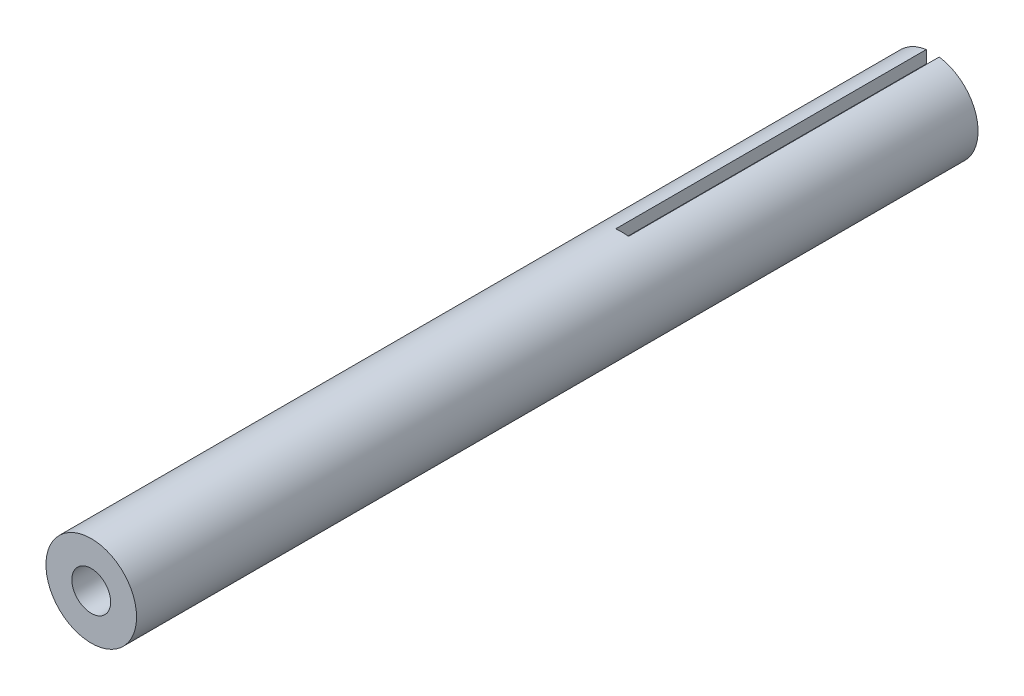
ISO-10303-21;
HEADER;
FILE_DESCRIPTION(('STEP AP214'),'2;1');
FILE_NAME('part.step','',(''),(''),'','','');
FILE_SCHEMA(('AUTOMOTIVE_DESIGN { 1 0 10303 214 1 1 1 1 }'));
ENDSEC;
DATA;
#1=APPLICATION_CONTEXT('core data for automotive mechanical design processes');
#2=APPLICATION_PROTOCOL_DEFINITION('international standard','automotive_design',2000,#1);
#3=PRODUCT_CONTEXT('',#1,'mechanical');
#4=PRODUCT('Part','Part','',(#3));
#5=PRODUCT_RELATED_PRODUCT_CATEGORY('part','',(#4));
#6=PRODUCT_DEFINITION_FORMATION('','',#4);
#7=PRODUCT_DEFINITION_CONTEXT('part definition',#1,'design');
#8=PRODUCT_DEFINITION('design','',#6,#7);
#9=PRODUCT_DEFINITION_SHAPE('','',#8);
#10=(LENGTH_UNIT() NAMED_UNIT(*) SI_UNIT(.MILLI.,.METRE.));
#11=(NAMED_UNIT(*) PLANE_ANGLE_UNIT() SI_UNIT($,.RADIAN.));
#12=(NAMED_UNIT(*) SI_UNIT($,.STERADIAN.) SOLID_ANGLE_UNIT());
#13=UNCERTAINTY_MEASURE_WITH_UNIT(LENGTH_MEASURE(1.E-05),#10,'distance_accuracy_value','');
#14=(GEOMETRIC_REPRESENTATION_CONTEXT(3) GLOBAL_UNCERTAINTY_ASSIGNED_CONTEXT((#13)) GLOBAL_UNIT_ASSIGNED_CONTEXT((#10,
#11,#12)) REPRESENTATION_CONTEXT('',''));
#15=CARTESIAN_POINT('',(0.,0.,0.));
#16=DIRECTION('',(0.,0.,1.));
#17=DIRECTION('',(1.,0.,0.));
#18=AXIS2_PLACEMENT_3D('',#15,#16,#17);
#19=CARTESIAN_POINT('',(0.,0.,206.375));
#20=DIRECTION('',(0.,0.,1.));
#21=DIRECTION('',(1.,0.,0.));
#22=AXIS2_PLACEMENT_3D('',#19,#20,#21);
#23=PLANE('',#22);
#24=CARTESIAN_POINT('',(0.,0.,206.375));
#25=DIRECTION('',(0.,0.,1.));
#26=DIRECTION('',(1.,0.,0.));
#27=AXIS2_PLACEMENT_3D('',#24,#25,#26);
#28=CIRCLE('',#27,11.1125);
#29=CARTESIAN_POINT('',(11.1125,0.,206.375));
#30=VERTEX_POINT('',#29);
#31=EDGE_CURVE('E106',#30,#30,#28,.T.);
#32=ORIENTED_EDGE('',*,*,#31,.T.);
#33=EDGE_LOOP('',(#32));
#34=FACE_BOUND('',#33,.T.);
#35=CARTESIAN_POINT('',(0.,0.,206.375));
#36=DIRECTION('',(0.,0.,1.));
#37=DIRECTION('',(1.,0.,0.));
#38=AXIS2_PLACEMENT_3D('',#35,#36,#37);
#39=CIRCLE('',#38,4.7625);
#40=CARTESIAN_POINT('',(4.7625,0.,206.375));
#41=VERTEX_POINT('',#40);
#42=EDGE_CURVE('E100',#41,#41,#39,.T.);
#43=ORIENTED_EDGE('',*,*,#42,.F.);
#44=EDGE_LOOP('',(#43));
#45=FACE_BOUND('',#44,.T.);
#46=ADVANCED_FACE('F33',(#34,#45),#23,.T.);
#47=CARTESIAN_POINT('',(0.,0.,0.));
#48=DIRECTION('',(0.,0.,1.));
#49=DIRECTION('',(1.,0.,0.));
#50=AXIS2_PLACEMENT_3D('',#47,#48,#49);
#51=PLANE('',#50);
#52=CARTESIAN_POINT('',(0.,0.,0.));
#53=DIRECTION('',(0.,0.,1.));
#54=DIRECTION('',(1.,0.,0.));
#55=AXIS2_PLACEMENT_3D('',#52,#53,#54);
#56=CIRCLE('',#55,11.1125);
#57=CARTESIAN_POINT('',(-1.5875,10.9985226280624,0.));
#58=VERTEX_POINT('',#57);
#59=CARTESIAN_POINT('',(1.5875,10.9985226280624,0.));
#60=VERTEX_POINT('',#59);
#61=EDGE_CURVE('E103',#58,#60,#56,.T.);
#62=ORIENTED_EDGE('',*,*,#61,.F.);
#63=DIRECTION('',(0.,1.,0.));
#64=VECTOR('',#63,1.);
#65=CARTESIAN_POINT('',(-1.5875,7.9375,0.));
#66=LINE('',#65,#64);
#67=CARTESIAN_POINT('',(-1.5875,7.9375,0.));
#68=VERTEX_POINT('',#67);
#69=EDGE_CURVE('E55',#68,#58,#66,.T.);
#70=ORIENTED_EDGE('',*,*,#69,.F.);
#71=DIRECTION('',(-1.,0.,0.));
#72=VECTOR('',#71,1.);
#73=CARTESIAN_POINT('',(-1.5875,7.9375,0.));
#74=LINE('',#73,#72);
#75=CARTESIAN_POINT('',(1.5875,7.9375,0.));
#76=VERTEX_POINT('',#75);
#77=EDGE_CURVE('E77',#76,#68,#74,.T.);
#78=ORIENTED_EDGE('',*,*,#77,.F.);
#79=DIRECTION('',(0.,1.,0.));
#80=VECTOR('',#79,1.);
#81=CARTESIAN_POINT('',(1.5875,7.9375,0.));
#82=LINE('',#81,#80);
#83=EDGE_CURVE('E96',#76,#60,#82,.T.);
#84=ORIENTED_EDGE('',*,*,#83,.T.);
#85=EDGE_LOOP('',(#62,#70,#78,#84));
#86=FACE_BOUND('',#85,.T.);
#87=CARTESIAN_POINT('',(0.,0.,0.));
#88=DIRECTION('',(0.,0.,1.));
#89=DIRECTION('',(1.,0.,0.));
#90=AXIS2_PLACEMENT_3D('',#87,#88,#89);
#91=CIRCLE('',#90,4.7625);
#92=CARTESIAN_POINT('',(4.7625,0.,0.));
#93=VERTEX_POINT('',#92);
#94=EDGE_CURVE('E95',#93,#93,#91,.T.);
#95=ORIENTED_EDGE('',*,*,#94,.T.);
#96=EDGE_LOOP('',(#95));
#97=FACE_BOUND('',#96,.T.);
#98=ADVANCED_FACE('F115',(#86,#97),#51,.F.);
#99=CARTESIAN_POINT('',(0.,0.,206.375));
#100=DIRECTION('',(0.,0.,-1.));
#101=DIRECTION('',(-1.,0.,0.));
#102=AXIS2_PLACEMENT_3D('',#99,#100,#101);
#103=CYLINDRICAL_SURFACE('',#102,11.1125);
#104=ORIENTED_EDGE('',*,*,#31,.F.);
#105=EDGE_LOOP('',(#104));
#106=FACE_BOUND('',#105,.T.);
#107=ORIENTED_EDGE('',*,*,#61,.T.);
#108=DIRECTION('',(0.,0.,-1.));
#109=VECTOR('',#108,1.);
#110=CARTESIAN_POINT('',(1.58750000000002,10.9985226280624,206.375));
#111=LINE('',#110,#109);
#112=CARTESIAN_POINT('',(1.58750000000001,10.9985226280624,76.2));
#113=VERTEX_POINT('',#112);
#114=EDGE_CURVE('E11',#60,#113,#111,.F.);
#115=ORIENTED_EDGE('',*,*,#114,.T.);
#116=CARTESIAN_POINT('',(0.,0.,76.2));
#117=DIRECTION('',(0.,0.,1.));
#118=DIRECTION('',(1.,0.,0.));
#119=AXIS2_PLACEMENT_3D('',#116,#117,#118);
#120=CIRCLE('',#119,11.1125);
#121=CARTESIAN_POINT('',(-1.58749999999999,10.9985226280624,76.2));
#122=VERTEX_POINT('',#121);
#123=EDGE_CURVE('E109',#113,#122,#120,.T.);
#124=ORIENTED_EDGE('',*,*,#123,.T.);
#125=DIRECTION('',(0.,0.,-1.));
#126=VECTOR('',#125,1.);
#127=CARTESIAN_POINT('',(-1.58749999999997,10.9985226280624,206.375));
#128=LINE('',#127,#126);
#129=EDGE_CURVE('E41',#122,#58,#128,.T.);
#130=ORIENTED_EDGE('',*,*,#129,.T.);
#131=EDGE_LOOP('',(#107,#115,#124,#130));
#132=FACE_BOUND('',#131,.T.);
#133=ADVANCED_FACE('F35',(#106,#132),#103,.T.);
#134=CARTESIAN_POINT('',(0.,0.,206.375));
#135=DIRECTION('',(0.,0.,-1.));
#136=DIRECTION('',(-1.,0.,0.));
#137=AXIS2_PLACEMENT_3D('',#134,#135,#136);
#138=CYLINDRICAL_SURFACE('',#137,4.7625);
#139=ORIENTED_EDGE('',*,*,#42,.T.);
#140=EDGE_LOOP('',(#139));
#141=FACE_BOUND('',#140,.T.);
#142=ORIENTED_EDGE('',*,*,#94,.F.);
#143=EDGE_LOOP('',(#142));
#144=FACE_BOUND('',#143,.T.);
#145=ADVANCED_FACE('F126',(#141,#144),#138,.F.);
#146=CARTESIAN_POINT('',(-1.5875,7.9375,0.));
#147=DIRECTION('',(-1.,0.,0.));
#148=DIRECTION('',(0.,0.,1.));
#149=AXIS2_PLACEMENT_3D('',#146,#147,#148);
#150=PLANE('',#149);
#151=DIRECTION('',(0.,1.,0.));
#152=VECTOR('',#151,1.);
#153=CARTESIAN_POINT('',(-1.58749999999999,7.9375,76.2));
#154=LINE('',#153,#152);
#155=CARTESIAN_POINT('',(-1.58749999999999,7.9375,76.2));
#156=VERTEX_POINT('',#155);
#157=EDGE_CURVE('E48',#156,#122,#154,.T.);
#158=ORIENTED_EDGE('',*,*,#157,.F.);
#159=DIRECTION('',(0.,0.,1.));
#160=VECTOR('',#159,1.);
#161=CARTESIAN_POINT('',(-1.5875,7.9375,0.));
#162=LINE('',#161,#160);
#163=EDGE_CURVE('E73',#68,#156,#162,.T.);
#164=ORIENTED_EDGE('',*,*,#163,.F.);
#165=ORIENTED_EDGE('',*,*,#69,.T.);
#166=ORIENTED_EDGE('',*,*,#129,.F.);
#167=EDGE_LOOP('',(#158,#164,#165,#166));
#168=FACE_BOUND('',#167,.T.);
#169=ADVANCED_FACE('F71',(#168),#150,.F.);
#170=CARTESIAN_POINT('',(1.5875,7.9375,0.));
#171=DIRECTION('',(1.,0.,0.));
#172=DIRECTION('',(0.,0.,-1.));
#173=AXIS2_PLACEMENT_3D('',#170,#171,#172);
#174=PLANE('',#173);
#175=ORIENTED_EDGE('',*,*,#83,.F.);
#176=DIRECTION('',(0.,0.,-1.));
#177=VECTOR('',#176,1.);
#178=CARTESIAN_POINT('',(1.5875,7.9375,0.));
#179=LINE('',#178,#177);
#180=CARTESIAN_POINT('',(1.58750000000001,7.9375,76.2));
#181=VERTEX_POINT('',#180);
#182=EDGE_CURVE('E86',#181,#76,#179,.T.);
#183=ORIENTED_EDGE('',*,*,#182,.F.);
#184=DIRECTION('',(0.,1.,0.));
#185=VECTOR('',#184,1.);
#186=CARTESIAN_POINT('',(1.58750000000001,7.9375,76.2));
#187=LINE('',#186,#185);
#188=EDGE_CURVE('E76',#181,#113,#187,.T.);
#189=ORIENTED_EDGE('',*,*,#188,.T.);
#190=ORIENTED_EDGE('',*,*,#114,.F.);
#191=EDGE_LOOP('',(#175,#183,#189,#190));
#192=FACE_BOUND('',#191,.T.);
#193=ADVANCED_FACE('F118',(#192),#174,.F.);
#194=CARTESIAN_POINT('',(-1.58749999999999,7.9375,76.2));
#195=DIRECTION('',(0.,0.,1.));
#196=DIRECTION('',(1.,0.,0.));
#197=AXIS2_PLACEMENT_3D('',#194,#195,#196);
#198=PLANE('',#197);
#199=ORIENTED_EDGE('',*,*,#188,.F.);
#200=DIRECTION('',(1.,0.,0.));
#201=VECTOR('',#200,1.);
#202=CARTESIAN_POINT('',(-1.58749999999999,7.9375,76.2));
#203=LINE('',#202,#201);
#204=EDGE_CURVE('E80',#156,#181,#203,.T.);
#205=ORIENTED_EDGE('',*,*,#204,.F.);
#206=ORIENTED_EDGE('',*,*,#157,.T.);
#207=ORIENTED_EDGE('',*,*,#123,.F.);
#208=EDGE_LOOP('',(#199,#205,#206,#207));
#209=FACE_BOUND('',#208,.T.);
#210=ADVANCED_FACE('F81',(#209),#198,.F.);
#211=CARTESIAN_POINT('',(0.,7.9375,0.));
#212=DIRECTION('',(0.,1.,0.));
#213=DIRECTION('',(0.,0.,1.));
#214=AXIS2_PLACEMENT_3D('',#211,#212,#213);
#215=PLANE('',#214);
#216=ORIENTED_EDGE('',*,*,#163,.T.);
#217=ORIENTED_EDGE('',*,*,#204,.T.);
#218=ORIENTED_EDGE('',*,*,#182,.T.);
#219=ORIENTED_EDGE('',*,*,#77,.T.);
#220=EDGE_LOOP('',(#216,#217,#218,#219));
#221=FACE_BOUND('',#220,.T.);
#222=ADVANCED_FACE('F88',(#221),#215,.T.);
#223=CLOSED_SHELL('',(#46,#98,#133,#145,#169,#193,#210,#222));
#224=MANIFOLD_SOLID_BREP('B2',#223);
#225=ADVANCED_BREP_SHAPE_REPRESENTATION('',(#18,#224),#14);
#226=SHAPE_DEFINITION_REPRESENTATION(#9,#225);
ENDSEC;
END-ISO-10303-21;
